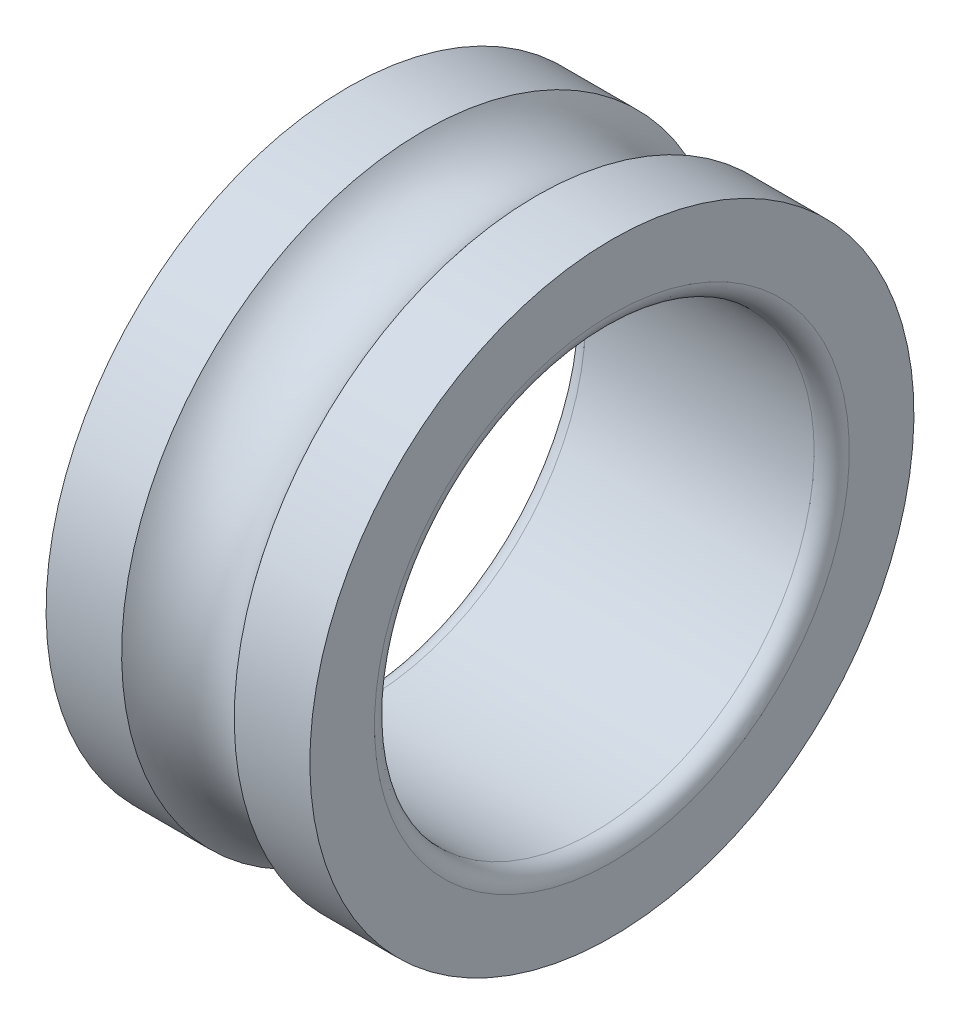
ISO-10303-21;
HEADER;
FILE_DESCRIPTION(('STEP AP214'),'2;1');
FILE_NAME('part.step','',(''),(''),'','','');
FILE_SCHEMA(('AUTOMOTIVE_DESIGN { 1 0 10303 214 1 1 1 1 }'));
ENDSEC;
DATA;
#1=APPLICATION_CONTEXT('core data for automotive mechanical design processes');
#2=APPLICATION_PROTOCOL_DEFINITION('international standard','automotive_design',2000,#1);
#3=PRODUCT_CONTEXT('',#1,'mechanical');
#4=PRODUCT('Part','Part','',(#3));
#5=PRODUCT_RELATED_PRODUCT_CATEGORY('part','',(#4));
#6=PRODUCT_DEFINITION_FORMATION('','',#4);
#7=PRODUCT_DEFINITION_CONTEXT('part definition',#1,'design');
#8=PRODUCT_DEFINITION('design','',#6,#7);
#9=PRODUCT_DEFINITION_SHAPE('','',#8);
#10=(LENGTH_UNIT() NAMED_UNIT(*) SI_UNIT(.MILLI.,.METRE.));
#11=(NAMED_UNIT(*) PLANE_ANGLE_UNIT() SI_UNIT($,.RADIAN.));
#12=(NAMED_UNIT(*) SI_UNIT($,.STERADIAN.) SOLID_ANGLE_UNIT());
#13=UNCERTAINTY_MEASURE_WITH_UNIT(LENGTH_MEASURE(1.E-05),#10,'distance_accuracy_value','');
#14=(GEOMETRIC_REPRESENTATION_CONTEXT(3) GLOBAL_UNCERTAINTY_ASSIGNED_CONTEXT((#13)) GLOBAL_UNIT_ASSIGNED_CONTEXT((#10,
#11,#12)) REPRESENTATION_CONTEXT('',''));
#15=CARTESIAN_POINT('',(0.,0.,0.));
#16=DIRECTION('',(0.,0.,1.));
#17=DIRECTION('',(1.,0.,0.));
#18=AXIS2_PLACEMENT_3D('',#15,#16,#17);
#19=CARTESIAN_POINT('',(12.8510883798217,0.,0.));
#20=DIRECTION('',(-1.,0.,0.));
#21=DIRECTION('',(0.,1.,0.));
#22=AXIS2_PLACEMENT_3D('',#19,#20,#21);
#23=CYLINDRICAL_SURFACE('',#22,17.175);
#24=CARTESIAN_POINT('',(10.7021767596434,0.,0.));
#25=DIRECTION('',(1.,0.,0.));
#26=DIRECTION('',(0.,1.,0.));
#27=AXIS2_PLACEMENT_3D('',#24,#25,#26);
#28=CIRCLE('',#27,17.175);
#29=CARTESIAN_POINT('',(10.7021767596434,17.175,0.));
#30=VERTEX_POINT('',#29);
#31=EDGE_CURVE('E11',#30,#30,#28,.T.);
#32=ORIENTED_EDGE('',*,*,#31,.T.);
#33=EDGE_LOOP('',(#32));
#34=FACE_BOUND('',#33,.T.);
#35=CARTESIAN_POINT('',(15.,0.,0.));
#36=DIRECTION('',(1.,0.,0.));
#37=DIRECTION('',(0.,1.,0.));
#38=AXIS2_PLACEMENT_3D('',#35,#36,#37);
#39=CIRCLE('',#38,17.175);
#40=CARTESIAN_POINT('',(15.,17.175,0.));
#41=VERTEX_POINT('',#40);
#42=EDGE_CURVE('E57',#41,#41,#39,.T.);
#43=ORIENTED_EDGE('',*,*,#42,.F.);
#44=EDGE_LOOP('',(#43));
#45=FACE_BOUND('',#44,.T.);
#46=ADVANCED_FACE('F16',(#34,#45),#23,.T.);
#47=CARTESIAN_POINT('',(7.5,0.,0.));
#48=DIRECTION('',(1.,0.,0.));
#49=DIRECTION('',(0.,0.,-1.));
#50=AXIS2_PLACEMENT_3D('',#47,#48,#49);
#51=TOROIDAL_SURFACE('',#50,19.52,3.969);
#52=CARTESIAN_POINT('',(4.29782324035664,0.,0.));
#53=DIRECTION('',(1.,0.,0.));
#54=DIRECTION('',(0.,1.,0.));
#55=AXIS2_PLACEMENT_3D('',#52,#53,#54);
#56=CIRCLE('',#55,17.175);
#57=CARTESIAN_POINT('',(4.29782324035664,17.175,0.));
#58=VERTEX_POINT('',#57);
#59=EDGE_CURVE('E25',#58,#58,#56,.T.);
#60=ORIENTED_EDGE('',*,*,#59,.T.);
#61=EDGE_LOOP('',(#60));
#62=FACE_BOUND('',#61,.T.);
#63=ORIENTED_EDGE('',*,*,#31,.F.);
#64=EDGE_LOOP('',(#63));
#65=FACE_BOUND('',#64,.T.);
#66=ADVANCED_FACE('F82',(#62,#65),#51,.F.);
#67=CARTESIAN_POINT('',(2.14891162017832,0.,0.));
#68=DIRECTION('',(-1.,0.,0.));
#69=DIRECTION('',(0.,1.,0.));
#70=AXIS2_PLACEMENT_3D('',#67,#68,#69);
#71=CYLINDRICAL_SURFACE('',#70,17.175);
#72=CARTESIAN_POINT('',(0.,0.,0.));
#73=DIRECTION('',(1.,0.,0.));
#74=DIRECTION('',(0.,1.,0.));
#75=AXIS2_PLACEMENT_3D('',#72,#73,#74);
#76=CIRCLE('',#75,17.175);
#77=CARTESIAN_POINT('',(0.,17.175,0.));
#78=VERTEX_POINT('',#77);
#79=EDGE_CURVE('E48',#78,#78,#76,.T.);
#80=ORIENTED_EDGE('',*,*,#79,.T.);
#81=EDGE_LOOP('',(#80));
#82=FACE_BOUND('',#81,.T.);
#83=ORIENTED_EDGE('',*,*,#59,.F.);
#84=EDGE_LOOP('',(#83));
#85=FACE_BOUND('',#84,.T.);
#86=ADVANCED_FACE('F49',(#82,#85),#71,.T.);
#87=CARTESIAN_POINT('',(0.,15.3375,0.));
#88=DIRECTION('',(-1.,0.,0.));
#89=DIRECTION('',(0.,-1.,0.));
#90=AXIS2_PLACEMENT_3D('',#87,#88,#89);
#91=PLANE('',#90);
#92=CARTESIAN_POINT('',(0.,0.,0.));
#93=DIRECTION('',(1.,0.,0.));
#94=DIRECTION('',(0.,1.,0.));
#95=AXIS2_PLACEMENT_3D('',#92,#93,#94);
#96=CIRCLE('',#95,13.5);
#97=CARTESIAN_POINT('',(0.,13.5,0.));
#98=VERTEX_POINT('',#97);
#99=EDGE_CURVE('E52',#98,#98,#96,.T.);
#100=ORIENTED_EDGE('',*,*,#99,.T.);
#101=EDGE_LOOP('',(#100));
#102=FACE_BOUND('',#101,.T.);
#103=ORIENTED_EDGE('',*,*,#79,.F.);
#104=EDGE_LOOP('',(#103));
#105=FACE_BOUND('',#104,.T.);
#106=ADVANCED_FACE('F92',(#102,#105),#91,.T.);
#107=CARTESIAN_POINT('',(1.,0.,0.));
#108=DIRECTION('',(1.,0.,0.));
#109=DIRECTION('',(0.,0.,-1.));
#110=AXIS2_PLACEMENT_3D('',#107,#108,#109);
#111=TOROIDAL_SURFACE('',#110,13.5,1.);
#112=CARTESIAN_POINT('',(1.,0.,0.));
#113=DIRECTION('',(1.,0.,0.));
#114=DIRECTION('',(0.,1.,0.));
#115=AXIS2_PLACEMENT_3D('',#112,#113,#114);
#116=CIRCLE('',#115,12.5);
#117=CARTESIAN_POINT('',(1.,12.5,0.));
#118=VERTEX_POINT('',#117);
#119=EDGE_CURVE('E54',#118,#118,#116,.T.);
#120=ORIENTED_EDGE('',*,*,#119,.T.);
#121=EDGE_LOOP('',(#120));
#122=FACE_BOUND('',#121,.T.);
#123=ORIENTED_EDGE('',*,*,#99,.F.);
#124=EDGE_LOOP('',(#123));
#125=FACE_BOUND('',#124,.T.);
#126=ADVANCED_FACE('F79',(#122,#125),#111,.T.);
#127=CARTESIAN_POINT('',(7.5,0.,0.));
#128=DIRECTION('',(-1.,0.,0.));
#129=DIRECTION('',(0.,1.,0.));
#130=AXIS2_PLACEMENT_3D('',#127,#128,#129);
#131=CYLINDRICAL_SURFACE('',#130,12.5);
#132=CARTESIAN_POINT('',(14.,0.,0.));
#133=DIRECTION('',(1.,0.,0.));
#134=DIRECTION('',(0.,1.,0.));
#135=AXIS2_PLACEMENT_3D('',#132,#133,#134);
#136=CIRCLE('',#135,12.5);
#137=CARTESIAN_POINT('',(14.,12.5,0.));
#138=VERTEX_POINT('',#137);
#139=EDGE_CURVE('E59',#138,#138,#136,.T.);
#140=ORIENTED_EDGE('',*,*,#139,.T.);
#141=EDGE_LOOP('',(#140));
#142=FACE_BOUND('',#141,.T.);
#143=ORIENTED_EDGE('',*,*,#119,.F.);
#144=EDGE_LOOP('',(#143));
#145=FACE_BOUND('',#144,.T.);
#146=ADVANCED_FACE('F18',(#142,#145),#131,.F.);
#147=CARTESIAN_POINT('',(14.,0.,0.));
#148=DIRECTION('',(1.,0.,0.));
#149=DIRECTION('',(0.,0.,-1.));
#150=AXIS2_PLACEMENT_3D('',#147,#148,#149);
#151=TOROIDAL_SURFACE('',#150,13.5,1.);
#152=CARTESIAN_POINT('',(15.,0.,0.));
#153=DIRECTION('',(1.,0.,0.));
#154=DIRECTION('',(0.,1.,0.));
#155=AXIS2_PLACEMENT_3D('',#152,#153,#154);
#156=CIRCLE('',#155,13.5);
#157=CARTESIAN_POINT('',(15.,13.5,0.));
#158=VERTEX_POINT('',#157);
#159=EDGE_CURVE('E60',#158,#158,#156,.T.);
#160=ORIENTED_EDGE('',*,*,#159,.T.);
#161=EDGE_LOOP('',(#160));
#162=FACE_BOUND('',#161,.T.);
#163=ORIENTED_EDGE('',*,*,#139,.F.);
#164=EDGE_LOOP('',(#163));
#165=FACE_BOUND('',#164,.T.);
#166=ADVANCED_FACE('F68',(#162,#165),#151,.T.);
#167=CARTESIAN_POINT('',(15.,15.3375,0.));
#168=DIRECTION('',(1.,0.,0.));
#169=DIRECTION('',(0.,1.,0.));
#170=AXIS2_PLACEMENT_3D('',#167,#168,#169);
#171=PLANE('',#170);
#172=ORIENTED_EDGE('',*,*,#42,.T.);
#173=EDGE_LOOP('',(#172));
#174=FACE_BOUND('',#173,.T.);
#175=ORIENTED_EDGE('',*,*,#159,.F.);
#176=EDGE_LOOP('',(#175));
#177=FACE_BOUND('',#176,.T.);
#178=ADVANCED_FACE('F70',(#174,#177),#171,.T.);
#179=CLOSED_SHELL('',(#46,#66,#86,#106,#126,#146,#166,#178));
#180=MANIFOLD_SOLID_BREP('B1',#179);
#181=ADVANCED_BREP_SHAPE_REPRESENTATION('',(#18,#180),#14);
#182=SHAPE_DEFINITION_REPRESENTATION(#9,#181);
ENDSEC;
END-ISO-10303-21;
